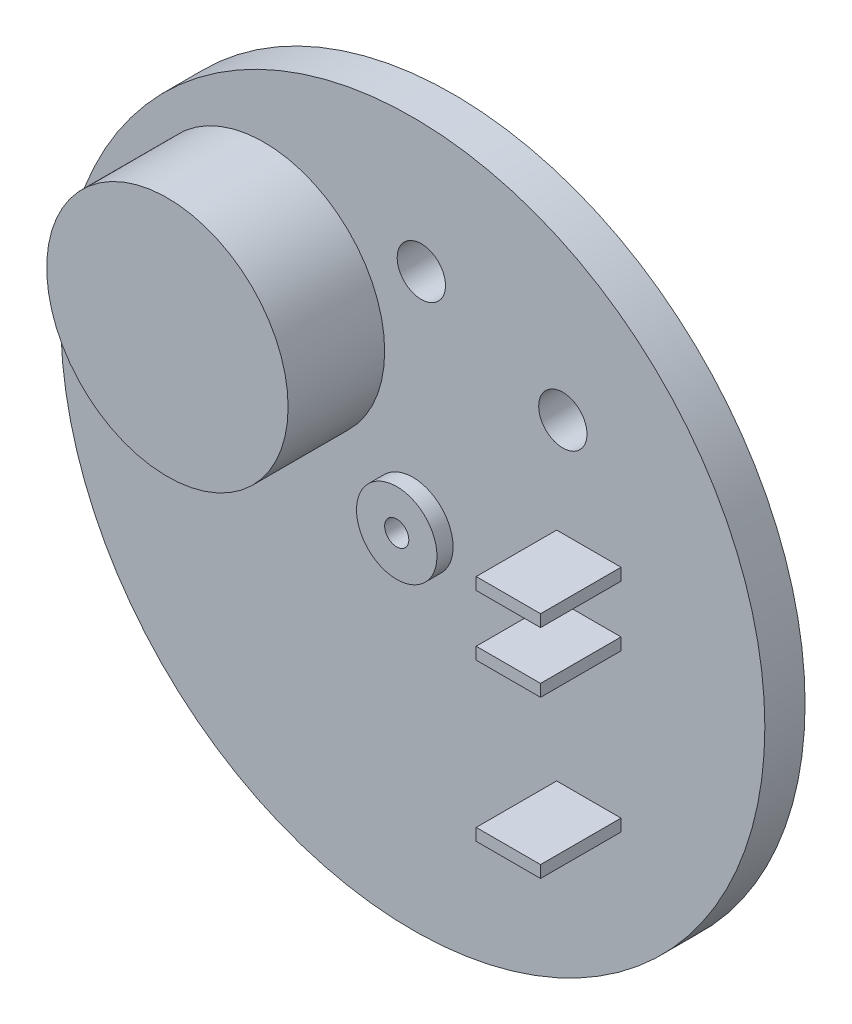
from build123d import *

# Parameters (mm, degrees)
ESQUISSE1_R             = 43.75
ESQUISSE1_R_2           = 1.5
BOSS_EXTRU_1_DEPTH      = 5
ESQUISSE2_R             = 15
BOSS_EXTRU_2_DEPTH      = 12
ESQUISSE3_W             = 8
ESQUISSE3_H             = 1.5
BOSS_EXTRU_3_DEPTH      = 10
ESQUISSE5_R             = 5
ESQUISSE5_R_2           = 1.5
BOSS_EXTRU_5_DEPTH      = 2
ESQUISSE7_R             = 3
ENL_V_MAT_EXTRU_1_DEPTH = 10


with BuildPart() as part:
    # Esquisse1 → Boss.-Extru.1 (new body)
    with BuildSketch(Plane.XY):
        Circle(ESQUISSE1_R)
        Circle(ESQUISSE1_R_2, mode=Mode.SUBTRACT)
    extrude(amount=BOSS_EXTRU_1_DEPTH)

    # Esquisse2 → Boss.-Extru.2 (add)
    with BuildSketch(Plane.XY.offset(5)):
        with Locations((-18.5, 16.815171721)):
            Circle(ESQUISSE2_R)
    extrude(amount=BOSS_EXTRU_2_DEPTH)

    # Esquisse3 → Boss.-Extru.3 (add)
    with BuildSketch(Plane.XY.offset(5)):
        with Locations((21.875, 0)):
            Rectangle(ESQUISSE3_W, ESQUISSE3_H)
        with Locations((21.875, 7.5)):
            Rectangle(ESQUISSE3_W, ESQUISSE3_H)
        with Locations((21.875, -19.5)):
            Rectangle(ESQUISSE3_W, ESQUISSE3_H)
    extrude(amount=BOSS_EXTRU_3_DEPTH)

    # Esquisse5 → Boss.-Extru.5 (add)
    with BuildSketch(Plane.XY.offset(5)):
        Circle(ESQUISSE5_R)
        Circle(ESQUISSE5_R_2, mode=Mode.SUBTRACT)
    extrude(amount=BOSS_EXTRU_5_DEPTH)

    # Esquisse7 → Enl_v. mat.-Extru.1 (cut)
    with BuildSketch(Plane(origin=(0, 0, 0), x_dir=(-1, 0, 0), z_dir=(0, 0, -1))):
        with Locations((-1.056186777, 27.661064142)):
            Circle(ESQUISSE7_R)
        with Locations((-18.640426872, 20.464224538)):
            Circle(ESQUISSE7_R)
    extrude(amount=-ENL_V_MAT_EXTRU_1_DEPTH, mode=Mode.SUBTRACT)


solid = part.part
